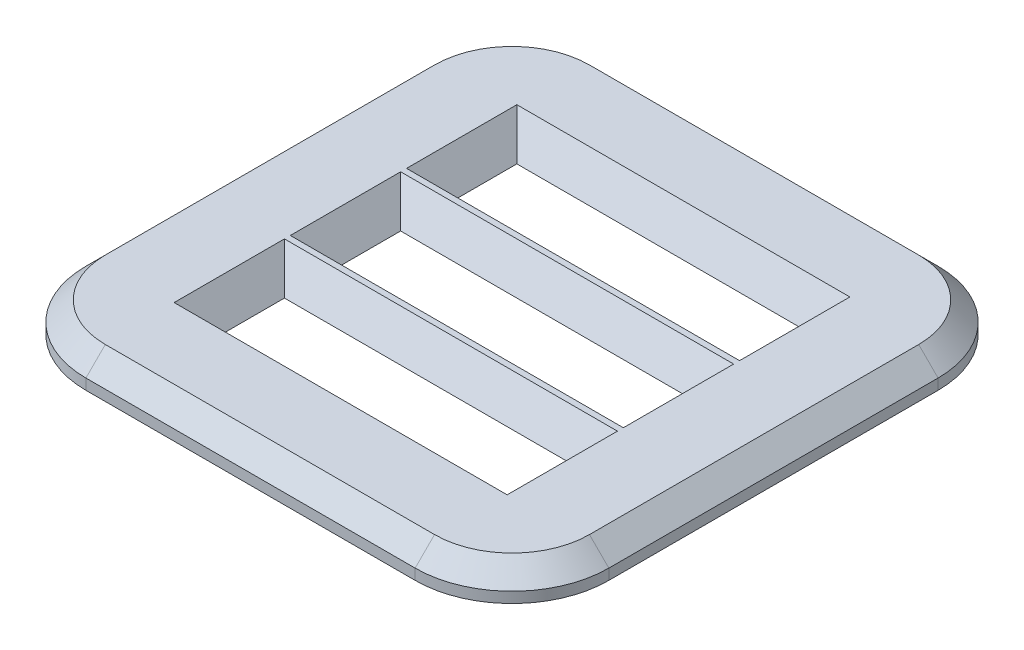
ISO-10303-21;
HEADER;
FILE_DESCRIPTION(('STEP AP214'),'2;1');
FILE_NAME('part.step','',(''),(''),'','','');
FILE_SCHEMA(('AUTOMOTIVE_DESIGN { 1 0 10303 214 1 1 1 1 }'));
ENDSEC;
DATA;
#1=APPLICATION_CONTEXT('core data for automotive mechanical design processes');
#2=APPLICATION_PROTOCOL_DEFINITION('international standard','automotive_design',2000,#1);
#3=PRODUCT_CONTEXT('',#1,'mechanical');
#4=PRODUCT('Part','Part','',(#3));
#5=PRODUCT_RELATED_PRODUCT_CATEGORY('part','',(#4));
#6=PRODUCT_DEFINITION_FORMATION('','',#4);
#7=PRODUCT_DEFINITION_CONTEXT('part definition',#1,'design');
#8=PRODUCT_DEFINITION('design','',#6,#7);
#9=PRODUCT_DEFINITION_SHAPE('','',#8);
#10=(LENGTH_UNIT() NAMED_UNIT(*) SI_UNIT(.MILLI.,.METRE.));
#11=(NAMED_UNIT(*) PLANE_ANGLE_UNIT() SI_UNIT($,.RADIAN.));
#12=(NAMED_UNIT(*) SI_UNIT($,.STERADIAN.) SOLID_ANGLE_UNIT());
#13=UNCERTAINTY_MEASURE_WITH_UNIT(LENGTH_MEASURE(1.E-05),#10,'distance_accuracy_value','');
#14=(GEOMETRIC_REPRESENTATION_CONTEXT(3) GLOBAL_UNCERTAINTY_ASSIGNED_CONTEXT((#13)) GLOBAL_UNIT_ASSIGNED_CONTEXT((#10,
#11,#12)) REPRESENTATION_CONTEXT('',''));
#15=CARTESIAN_POINT('',(0.,0.,0.));
#16=DIRECTION('',(0.,0.,1.));
#17=DIRECTION('',(1.,0.,0.));
#18=AXIS2_PLACEMENT_3D('',#15,#16,#17);
#19=CARTESIAN_POINT('',(-2.7,0.31,-2.7));
#20=DIRECTION('',(1.,0.,0.));
#21=DIRECTION('',(0.,0.,-1.));
#22=AXIS2_PLACEMENT_3D('',#19,#20,#21);
#23=PLANE('',#22);
#24=DIRECTION('',(0.,-1.,0.));
#25=VECTOR('',#24,1.);
#26=CARTESIAN_POINT('',(-2.7,0.31,1.7));
#27=LINE('',#26,#25);
#28=CARTESIAN_POINT('',(-2.7,0.,1.7));
#29=VERTEX_POINT('',#28);
#30=CARTESIAN_POINT('',(-2.7,0.11,1.7));
#31=VERTEX_POINT('',#30);
#32=EDGE_CURVE('E268',#29,#31,#27,.F.);
#33=ORIENTED_EDGE('',*,*,#32,.T.);
#34=DIRECTION('',(0.,0.,-1.));
#35=VECTOR('',#34,1.);
#36=CARTESIAN_POINT('',(-2.7,0.11,-2.7));
#37=LINE('',#36,#35);
#38=CARTESIAN_POINT('',(-2.7,0.11,-1.7));
#39=VERTEX_POINT('',#38);
#40=EDGE_CURVE('E320',#31,#39,#37,.T.);
#41=ORIENTED_EDGE('',*,*,#40,.T.);
#42=DIRECTION('',(0.,-1.,0.));
#43=VECTOR('',#42,1.);
#44=CARTESIAN_POINT('',(-2.7,0.31,-1.7));
#45=LINE('',#44,#43);
#46=CARTESIAN_POINT('',(-2.7,0.,-1.7));
#47=VERTEX_POINT('',#46);
#48=EDGE_CURVE('E271',#39,#47,#45,.T.);
#49=ORIENTED_EDGE('',*,*,#48,.T.);
#50=DIRECTION('',(0.,0.,1.));
#51=VECTOR('',#50,1.);
#52=CARTESIAN_POINT('',(-2.7,0.,-2.7));
#53=LINE('',#52,#51);
#54=EDGE_CURVE('E255',#47,#29,#53,.T.);
#55=ORIENTED_EDGE('',*,*,#54,.T.);
#56=EDGE_LOOP('',(#33,#41,#49,#55));
#57=FACE_BOUND('',#56,.T.);
#58=ADVANCED_FACE('F43',(#57),#23,.F.);
#59=CARTESIAN_POINT('',(2.7,0.31,2.7));
#60=DIRECTION('',(0.,0.,-1.));
#61=DIRECTION('',(-1.,0.,0.));
#62=AXIS2_PLACEMENT_3D('',#59,#60,#61);
#63=PLANE('',#62);
#64=DIRECTION('',(0.,-1.,0.));
#65=VECTOR('',#64,1.);
#66=CARTESIAN_POINT('',(1.7,0.31,2.7));
#67=LINE('',#66,#65);
#68=CARTESIAN_POINT('',(1.7,0.,2.7));
#69=VERTEX_POINT('',#68);
#70=CARTESIAN_POINT('',(1.7,0.11,2.7));
#71=VERTEX_POINT('',#70);
#72=EDGE_CURVE('E293',#69,#71,#67,.F.);
#73=ORIENTED_EDGE('',*,*,#72,.T.);
#74=DIRECTION('',(-1.,0.,0.));
#75=VECTOR('',#74,1.);
#76=CARTESIAN_POINT('',(2.7,0.11,2.7));
#77=LINE('',#76,#75);
#78=CARTESIAN_POINT('',(-1.7,0.11,2.7));
#79=VERTEX_POINT('',#78);
#80=EDGE_CURVE('E316',#71,#79,#77,.T.);
#81=ORIENTED_EDGE('',*,*,#80,.T.);
#82=DIRECTION('',(0.,-1.,0.));
#83=VECTOR('',#82,1.);
#84=CARTESIAN_POINT('',(-1.7,0.31,2.7));
#85=LINE('',#84,#83);
#86=CARTESIAN_POINT('',(-1.7,0.,2.7));
#87=VERTEX_POINT('',#86);
#88=EDGE_CURVE('E291',#79,#87,#85,.T.);
#89=ORIENTED_EDGE('',*,*,#88,.T.);
#90=DIRECTION('',(1.,0.,0.));
#91=VECTOR('',#90,1.);
#92=CARTESIAN_POINT('',(2.7,0.,2.7));
#93=LINE('',#92,#91);
#94=EDGE_CURVE('E258',#87,#69,#93,.T.);
#95=ORIENTED_EDGE('',*,*,#94,.T.);
#96=EDGE_LOOP('',(#73,#81,#89,#95));
#97=FACE_BOUND('',#96,.T.);
#98=ADVANCED_FACE('F477',(#97),#63,.F.);
#99=CARTESIAN_POINT('',(2.7,0.31,-2.7));
#100=DIRECTION('',(-1.,0.,0.));
#101=DIRECTION('',(0.,0.,1.));
#102=AXIS2_PLACEMENT_3D('',#99,#100,#101);
#103=PLANE('',#102);
#104=DIRECTION('',(0.,-1.,0.));
#105=VECTOR('',#104,1.);
#106=CARTESIAN_POINT('',(2.7,0.31,-1.7));
#107=LINE('',#106,#105);
#108=CARTESIAN_POINT('',(2.7,0.,-1.7));
#109=VERTEX_POINT('',#108);
#110=CARTESIAN_POINT('',(2.7,0.11,-1.7));
#111=VERTEX_POINT('',#110);
#112=EDGE_CURVE('E288',#109,#111,#107,.F.);
#113=ORIENTED_EDGE('',*,*,#112,.T.);
#114=DIRECTION('',(0.,0.,1.));
#115=VECTOR('',#114,1.);
#116=CARTESIAN_POINT('',(2.7,0.11,-2.7));
#117=LINE('',#116,#115);
#118=CARTESIAN_POINT('',(2.7,0.11,1.7));
#119=VERTEX_POINT('',#118);
#120=EDGE_CURVE('E328',#111,#119,#117,.T.);
#121=ORIENTED_EDGE('',*,*,#120,.T.);
#122=DIRECTION('',(0.,-1.,0.));
#123=VECTOR('',#122,1.);
#124=CARTESIAN_POINT('',(2.7,0.31,1.7));
#125=LINE('',#124,#123);
#126=CARTESIAN_POINT('',(2.7,0.,1.7));
#127=VERTEX_POINT('',#126);
#128=EDGE_CURVE('E286',#119,#127,#125,.T.);
#129=ORIENTED_EDGE('',*,*,#128,.T.);
#130=DIRECTION('',(0.,0.,-1.));
#131=VECTOR('',#130,1.);
#132=CARTESIAN_POINT('',(2.7,0.,-2.7));
#133=LINE('',#132,#131);
#134=EDGE_CURVE('E262',#127,#109,#133,.T.);
#135=ORIENTED_EDGE('',*,*,#134,.T.);
#136=EDGE_LOOP('',(#113,#121,#129,#135));
#137=FACE_BOUND('',#136,.T.);
#138=ADVANCED_FACE('F467',(#137),#103,.F.);
#139=CARTESIAN_POINT('',(2.7,0.31,-2.7));
#140=DIRECTION('',(0.,0.,1.));
#141=DIRECTION('',(1.,0.,0.));
#142=AXIS2_PLACEMENT_3D('',#139,#140,#141);
#143=PLANE('',#142);
#144=DIRECTION('',(0.,-1.,0.));
#145=VECTOR('',#144,1.);
#146=CARTESIAN_POINT('',(-1.7,0.31,-2.7));
#147=LINE('',#146,#145);
#148=CARTESIAN_POINT('',(-1.7,0.,-2.7));
#149=VERTEX_POINT('',#148);
#150=CARTESIAN_POINT('',(-1.7,0.11,-2.7));
#151=VERTEX_POINT('',#150);
#152=EDGE_CURVE('E283',#149,#151,#147,.F.);
#153=ORIENTED_EDGE('',*,*,#152,.T.);
#154=DIRECTION('',(1.,0.,0.));
#155=VECTOR('',#154,1.);
#156=CARTESIAN_POINT('',(2.7,0.11,-2.7));
#157=LINE('',#156,#155);
#158=CARTESIAN_POINT('',(1.7,0.11,-2.7));
#159=VERTEX_POINT('',#158);
#160=EDGE_CURVE('E324',#151,#159,#157,.T.);
#161=ORIENTED_EDGE('',*,*,#160,.T.);
#162=DIRECTION('',(0.,-1.,0.));
#163=VECTOR('',#162,1.);
#164=CARTESIAN_POINT('',(1.7,0.31,-2.7));
#165=LINE('',#164,#163);
#166=CARTESIAN_POINT('',(1.7,0.,-2.7));
#167=VERTEX_POINT('',#166);
#168=EDGE_CURVE('E281',#159,#167,#165,.T.);
#169=ORIENTED_EDGE('',*,*,#168,.T.);
#170=DIRECTION('',(-1.,0.,0.));
#171=VECTOR('',#170,1.);
#172=CARTESIAN_POINT('',(2.7,0.,-2.7));
#173=LINE('',#172,#171);
#174=EDGE_CURVE('E265',#167,#149,#173,.T.);
#175=ORIENTED_EDGE('',*,*,#174,.T.);
#176=EDGE_LOOP('',(#153,#161,#169,#175));
#177=FACE_BOUND('',#176,.T.);
#178=ADVANCED_FACE('F460',(#177),#143,.F.);
#179=CARTESIAN_POINT('',(0.,0.31,0.));
#180=DIRECTION('',(0.,-1.,0.));
#181=DIRECTION('',(0.,0.,-1.));
#182=AXIS2_PLACEMENT_3D('',#179,#180,#181);
#183=PLANE('',#182);
#184=DIRECTION('',(-1.,0.,0.));
#185=VECTOR('',#184,1.);
#186=CARTESIAN_POINT('',(0.,0.31,1.76949223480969));
#187=LINE('',#186,#185);
#188=CARTESIAN_POINT('',(1.71949223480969,0.31,1.76949223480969));
#189=VERTEX_POINT('',#188);
#190=CARTESIAN_POINT('',(-1.71949223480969,0.31,1.76949223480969));
#191=VERTEX_POINT('',#190);
#192=EDGE_CURVE('E53',#189,#191,#187,.T.);
#193=ORIENTED_EDGE('',*,*,#192,.T.);
#194=DIRECTION('',(0.,0.,-1.));
#195=VECTOR('',#194,1.);
#196=CARTESIAN_POINT('',(-1.71949223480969,0.31,0.));
#197=LINE('',#196,#195);
#198=CARTESIAN_POINT('',(-1.71949223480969,0.31,0.630507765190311));
#199=VERTEX_POINT('',#198);
#200=EDGE_CURVE('E11',#191,#199,#197,.T.);
#201=ORIENTED_EDGE('',*,*,#200,.T.);
#202=DIRECTION('',(1.,0.,0.));
#203=VECTOR('',#202,1.);
#204=CARTESIAN_POINT('',(0.,0.31,0.630507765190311));
#205=LINE('',#204,#203);
#206=CARTESIAN_POINT('',(1.71949223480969,0.31,0.630507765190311));
#207=VERTEX_POINT('',#206);
#208=EDGE_CURVE('E366',#199,#207,#205,.T.);
#209=ORIENTED_EDGE('',*,*,#208,.T.);
#210=DIRECTION('',(0.,0.,1.));
#211=VECTOR('',#210,1.);
#212=CARTESIAN_POINT('',(1.71949223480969,0.31,0.));
#213=LINE('',#212,#211);
#214=EDGE_CURVE('E64',#207,#189,#213,.T.);
#215=ORIENTED_EDGE('',*,*,#214,.T.);
#216=EDGE_LOOP('',(#193,#201,#209,#215));
#217=FACE_BOUND('',#216,.T.);
#218=DIRECTION('',(1.,0.,0.));
#219=VECTOR('',#218,1.);
#220=CARTESIAN_POINT('',(0.,0.31,-1.76949223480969));
#221=LINE('',#220,#219);
#222=CARTESIAN_POINT('',(-1.71949223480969,0.31,-1.76949223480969));
#223=VERTEX_POINT('',#222);
#224=CARTESIAN_POINT('',(1.71949223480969,0.31,-1.76949223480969));
#225=VERTEX_POINT('',#224);
#226=EDGE_CURVE('E361',#223,#225,#221,.T.);
#227=ORIENTED_EDGE('',*,*,#226,.T.);
#228=DIRECTION('',(0.,0.,1.));
#229=VECTOR('',#228,1.);
#230=CARTESIAN_POINT('',(1.71949223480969,0.31,0.));
#231=LINE('',#230,#229);
#232=CARTESIAN_POINT('',(1.71949223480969,0.31,-0.630507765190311));
#233=VERTEX_POINT('',#232);
#234=EDGE_CURVE('E364',#225,#233,#231,.T.);
#235=ORIENTED_EDGE('',*,*,#234,.T.);
#236=DIRECTION('',(-1.,0.,0.));
#237=VECTOR('',#236,1.);
#238=CARTESIAN_POINT('',(0.,0.31,-0.630507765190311));
#239=LINE('',#238,#237);
#240=CARTESIAN_POINT('',(-1.71949223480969,0.31,-0.630507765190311));
#241=VERTEX_POINT('',#240);
#242=EDGE_CURVE('E221',#233,#241,#239,.T.);
#243=ORIENTED_EDGE('',*,*,#242,.T.);
#244=DIRECTION('',(0.,0.,-1.));
#245=VECTOR('',#244,1.);
#246=CARTESIAN_POINT('',(-1.71949223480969,0.31,0.));
#247=LINE('',#246,#245);
#248=EDGE_CURVE('E359',#241,#223,#247,.T.);
#249=ORIENTED_EDGE('',*,*,#248,.T.);
#250=EDGE_LOOP('',(#227,#235,#243,#249));
#251=FACE_BOUND('',#250,.T.);
#252=DIRECTION('',(0.,0.,1.));
#253=VECTOR('',#252,1.);
#254=CARTESIAN_POINT('',(1.71949223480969,0.31,0.));
#255=LINE('',#254,#253);
#256=CARTESIAN_POINT('',(1.71949223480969,0.31,-0.569492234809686));
#257=VERTEX_POINT('',#256);
#258=CARTESIAN_POINT('',(1.71949223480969,0.31,0.569492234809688));
#259=VERTEX_POINT('',#258);
#260=EDGE_CURVE('E354',#257,#259,#255,.T.);
#261=ORIENTED_EDGE('',*,*,#260,.T.);
#262=DIRECTION('',(-1.,0.,0.));
#263=VECTOR('',#262,1.);
#264=CARTESIAN_POINT('',(0.,0.31,0.569492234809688));
#265=LINE('',#264,#263);
#266=CARTESIAN_POINT('',(-1.71949223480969,0.31,0.569492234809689));
#267=VERTEX_POINT('',#266);
#268=EDGE_CURVE('E356',#259,#267,#265,.T.);
#269=ORIENTED_EDGE('',*,*,#268,.T.);
#270=DIRECTION('',(0.,0.,-1.));
#271=VECTOR('',#270,1.);
#272=CARTESIAN_POINT('',(-1.71949223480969,0.31,0.));
#273=LINE('',#272,#271);
#274=CARTESIAN_POINT('',(-1.71949223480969,0.31,-0.569492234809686));
#275=VERTEX_POINT('',#274);
#276=EDGE_CURVE('E352',#267,#275,#273,.T.);
#277=ORIENTED_EDGE('',*,*,#276,.T.);
#278=DIRECTION('',(1.,0.,0.));
#279=VECTOR('',#278,1.);
#280=CARTESIAN_POINT('',(0.,0.31,-0.569492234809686));
#281=LINE('',#280,#279);
#282=EDGE_CURVE('E330',#275,#257,#281,.T.);
#283=ORIENTED_EDGE('',*,*,#282,.T.);
#284=EDGE_LOOP('',(#261,#269,#277,#283));
#285=FACE_BOUND('',#284,.T.);
#286=DIRECTION('',(1.,0.,0.));
#287=VECTOR('',#286,1.);
#288=CARTESIAN_POINT('',(0.,0.31,2.5));
#289=LINE('',#288,#287);
#290=CARTESIAN_POINT('',(-1.7,0.31,2.5));
#291=VERTEX_POINT('',#290);
#292=CARTESIAN_POINT('',(1.7,0.31,2.5));
#293=VERTEX_POINT('',#292);
#294=EDGE_CURVE('E308',#291,#293,#289,.T.);
#295=ORIENTED_EDGE('',*,*,#294,.T.);
#296=CARTESIAN_POINT('',(1.7,0.31,1.7));
#297=DIRECTION('',(0.,-1.,0.));
#298=DIRECTION('',(0.,0.,-1.));
#299=AXIS2_PLACEMENT_3D('',#296,#297,#298);
#300=CIRCLE('',#299,0.800000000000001);
#301=CARTESIAN_POINT('',(2.5,0.31,1.7));
#302=VERTEX_POINT('',#301);
#303=EDGE_CURVE('E310',#293,#302,#300,.F.);
#304=ORIENTED_EDGE('',*,*,#303,.T.);
#305=DIRECTION('',(0.,0.,-1.));
#306=VECTOR('',#305,1.);
#307=CARTESIAN_POINT('',(2.5,0.31,0.));
#308=LINE('',#307,#306);
#309=CARTESIAN_POINT('',(2.5,0.31,-1.7));
#310=VERTEX_POINT('',#309);
#311=EDGE_CURVE('E296',#302,#310,#308,.T.);
#312=ORIENTED_EDGE('',*,*,#311,.T.);
#313=CARTESIAN_POINT('',(1.7,0.31,-1.7));
#314=DIRECTION('',(0.,-1.,0.));
#315=DIRECTION('',(0.,0.,-1.));
#316=AXIS2_PLACEMENT_3D('',#313,#314,#315);
#317=CIRCLE('',#316,0.800000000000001);
#318=CARTESIAN_POINT('',(1.7,0.31,-2.5));
#319=VERTEX_POINT('',#318);
#320=EDGE_CURVE('E298',#310,#319,#317,.F.);
#321=ORIENTED_EDGE('',*,*,#320,.T.);
#322=DIRECTION('',(-1.,0.,0.));
#323=VECTOR('',#322,1.);
#324=CARTESIAN_POINT('',(0.,0.31,-2.5));
#325=LINE('',#324,#323);
#326=CARTESIAN_POINT('',(-1.7,0.31,-2.5));
#327=VERTEX_POINT('',#326);
#328=EDGE_CURVE('E300',#319,#327,#325,.T.);
#329=ORIENTED_EDGE('',*,*,#328,.T.);
#330=CARTESIAN_POINT('',(-1.7,0.31,-1.7));
#331=DIRECTION('',(0.,-1.,0.));
#332=DIRECTION('',(0.,0.,-1.));
#333=AXIS2_PLACEMENT_3D('',#330,#331,#332);
#334=CIRCLE('',#333,0.800000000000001);
#335=CARTESIAN_POINT('',(-2.5,0.31,-1.7));
#336=VERTEX_POINT('',#335);
#337=EDGE_CURVE('E302',#327,#336,#334,.F.);
#338=ORIENTED_EDGE('',*,*,#337,.T.);
#339=DIRECTION('',(0.,0.,1.));
#340=VECTOR('',#339,1.);
#341=CARTESIAN_POINT('',(-2.5,0.31,0.));
#342=LINE('',#341,#340);
#343=CARTESIAN_POINT('',(-2.5,0.31,1.7));
#344=VERTEX_POINT('',#343);
#345=EDGE_CURVE('E304',#336,#344,#342,.T.);
#346=ORIENTED_EDGE('',*,*,#345,.T.);
#347=CARTESIAN_POINT('',(-1.7,0.31,1.7));
#348=DIRECTION('',(0.,-1.,0.));
#349=DIRECTION('',(0.,0.,-1.));
#350=AXIS2_PLACEMENT_3D('',#347,#348,#349);
#351=CIRCLE('',#350,0.800000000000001);
#352=EDGE_CURVE('E306',#344,#291,#351,.F.);
#353=ORIENTED_EDGE('',*,*,#352,.T.);
#354=EDGE_LOOP('',(#295,#304,#312,#321,#329,#338,#346,#353));
#355=FACE_BOUND('',#354,.T.);
#356=ADVANCED_FACE('F404',(#217,#251,#285,#355),#183,.F.);
#357=CARTESIAN_POINT('',(0.,0.,0.));
#358=DIRECTION('',(0.,-1.,0.));
#359=DIRECTION('',(0.,0.,-1.));
#360=AXIS2_PLACEMENT_3D('',#357,#358,#359);
#361=PLANE('',#360);
#362=DIRECTION('',(-1.,0.,0.));
#363=VECTOR('',#362,1.);
#364=CARTESIAN_POINT('',(1.5,0.,0.849999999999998));
#365=LINE('',#364,#363);
#366=CARTESIAN_POINT('',(1.5,0.,0.849999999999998));
#367=VERTEX_POINT('',#366);
#368=CARTESIAN_POINT('',(-1.5,0.,0.849999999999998));
#369=VERTEX_POINT('',#368);
#370=EDGE_CURVE('E216',#367,#369,#365,.T.);
#371=ORIENTED_EDGE('',*,*,#370,.T.);
#372=DIRECTION('',(0.,0.,1.));
#373=VECTOR('',#372,1.);
#374=CARTESIAN_POINT('',(-1.5,0.,0.849999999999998));
#375=LINE('',#374,#373);
#376=CARTESIAN_POINT('',(-1.5,0.,1.55));
#377=VERTEX_POINT('',#376);
#378=EDGE_CURVE('E244',#369,#377,#375,.T.);
#379=ORIENTED_EDGE('',*,*,#378,.T.);
#380=DIRECTION('',(1.,0.,0.));
#381=VECTOR('',#380,1.);
#382=CARTESIAN_POINT('',(1.5,0.,1.55));
#383=LINE('',#382,#381);
#384=CARTESIAN_POINT('',(1.5,0.,1.55));
#385=VERTEX_POINT('',#384);
#386=EDGE_CURVE('E241',#377,#385,#383,.T.);
#387=ORIENTED_EDGE('',*,*,#386,.T.);
#388=DIRECTION('',(0.,0.,-1.));
#389=VECTOR('',#388,1.);
#390=CARTESIAN_POINT('',(1.5,0.,0.849999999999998));
#391=LINE('',#390,#389);
#392=EDGE_CURVE('E239',#385,#367,#391,.T.);
#393=ORIENTED_EDGE('',*,*,#392,.T.);
#394=EDGE_LOOP('',(#371,#379,#387,#393));
#395=FACE_BOUND('',#394,.T.);
#396=DIRECTION('',(0.,0.,-1.));
#397=VECTOR('',#396,1.);
#398=CARTESIAN_POINT('',(1.5,0.,-0.849999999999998));
#399=LINE('',#398,#397);
#400=CARTESIAN_POINT('',(1.5,0.,-0.849999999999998));
#401=VERTEX_POINT('',#400);
#402=CARTESIAN_POINT('',(1.5,0.,-1.55));
#403=VERTEX_POINT('',#402);
#404=EDGE_CURVE('E210',#401,#403,#399,.T.);
#405=ORIENTED_EDGE('',*,*,#404,.T.);
#406=DIRECTION('',(-1.,0.,0.));
#407=VECTOR('',#406,1.);
#408=CARTESIAN_POINT('',(1.5,0.,-1.55));
#409=LINE('',#408,#407);
#410=CARTESIAN_POINT('',(-1.5,0.,-1.55));
#411=VERTEX_POINT('',#410);
#412=EDGE_CURVE('E232',#403,#411,#409,.T.);
#413=ORIENTED_EDGE('',*,*,#412,.T.);
#414=DIRECTION('',(0.,0.,1.));
#415=VECTOR('',#414,1.);
#416=CARTESIAN_POINT('',(-1.5,0.,-0.849999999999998));
#417=LINE('',#416,#415);
#418=CARTESIAN_POINT('',(-1.5,0.,-0.849999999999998));
#419=VERTEX_POINT('',#418);
#420=EDGE_CURVE('E212',#411,#419,#417,.T.);
#421=ORIENTED_EDGE('',*,*,#420,.T.);
#422=DIRECTION('',(1.,0.,0.));
#423=VECTOR('',#422,1.);
#424=CARTESIAN_POINT('',(1.5,0.,-0.849999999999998));
#425=LINE('',#424,#423);
#426=EDGE_CURVE('E205',#419,#401,#425,.T.);
#427=ORIENTED_EDGE('',*,*,#426,.T.);
#428=EDGE_LOOP('',(#405,#413,#421,#427));
#429=FACE_BOUND('',#428,.T.);
#430=DIRECTION('',(0.,0.,1.));
#431=VECTOR('',#430,1.);
#432=CARTESIAN_POINT('',(-1.5,0.,-0.349999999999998));
#433=LINE('',#432,#431);
#434=CARTESIAN_POINT('',(-1.5,0.,-0.349999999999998));
#435=VERTEX_POINT('',#434);
#436=CARTESIAN_POINT('',(-1.5,0.,0.350000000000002));
#437=VERTEX_POINT('',#436);
#438=EDGE_CURVE('E231',#435,#437,#433,.T.);
#439=ORIENTED_EDGE('',*,*,#438,.T.);
#440=DIRECTION('',(1.,0.,0.));
#441=VECTOR('',#440,1.);
#442=CARTESIAN_POINT('',(1.5,0.,0.350000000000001));
#443=LINE('',#442,#441);
#444=CARTESIAN_POINT('',(1.5,0.,0.350000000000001));
#445=VERTEX_POINT('',#444);
#446=EDGE_CURVE('E234',#437,#445,#443,.T.);
#447=ORIENTED_EDGE('',*,*,#446,.T.);
#448=DIRECTION('',(0.,0.,-1.));
#449=VECTOR('',#448,1.);
#450=CARTESIAN_POINT('',(1.5,0.,-0.349999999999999));
#451=LINE('',#450,#449);
#452=CARTESIAN_POINT('',(1.5,0.,-0.349999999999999));
#453=VERTEX_POINT('',#452);
#454=EDGE_CURVE('E250',#445,#453,#451,.T.);
#455=ORIENTED_EDGE('',*,*,#454,.T.);
#456=DIRECTION('',(-1.,0.,0.));
#457=VECTOR('',#456,1.);
#458=CARTESIAN_POINT('',(1.5,0.,-0.349999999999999));
#459=LINE('',#458,#457);
#460=EDGE_CURVE('E252',#453,#435,#459,.T.);
#461=ORIENTED_EDGE('',*,*,#460,.T.);
#462=EDGE_LOOP('',(#439,#447,#455,#461));
#463=FACE_BOUND('',#462,.T.);
#464=ORIENTED_EDGE('',*,*,#54,.F.);
#465=CARTESIAN_POINT('',(-1.7,0.,-1.7));
#466=DIRECTION('',(0.,-1.,0.));
#467=DIRECTION('',(0.,0.,-1.));
#468=AXIS2_PLACEMENT_3D('',#465,#466,#467);
#469=CIRCLE('',#468,1.);
#470=EDGE_CURVE('E279',#47,#149,#469,.T.);
#471=ORIENTED_EDGE('',*,*,#470,.T.);
#472=ORIENTED_EDGE('',*,*,#174,.F.);
#473=CARTESIAN_POINT('',(1.7,0.,-1.7));
#474=DIRECTION('',(0.,-1.,0.));
#475=DIRECTION('',(0.,0.,-1.));
#476=AXIS2_PLACEMENT_3D('',#473,#474,#475);
#477=CIRCLE('',#476,1.);
#478=EDGE_CURVE('E277',#167,#109,#477,.T.);
#479=ORIENTED_EDGE('',*,*,#478,.T.);
#480=ORIENTED_EDGE('',*,*,#134,.F.);
#481=CARTESIAN_POINT('',(1.7,0.,1.7));
#482=DIRECTION('',(0.,-1.,0.));
#483=DIRECTION('',(0.,0.,-1.));
#484=AXIS2_PLACEMENT_3D('',#481,#482,#483);
#485=CIRCLE('',#484,1.);
#486=EDGE_CURVE('E275',#127,#69,#485,.T.);
#487=ORIENTED_EDGE('',*,*,#486,.T.);
#488=ORIENTED_EDGE('',*,*,#94,.F.);
#489=CARTESIAN_POINT('',(-1.7,0.,1.7));
#490=DIRECTION('',(0.,-1.,0.));
#491=DIRECTION('',(0.,0.,-1.));
#492=AXIS2_PLACEMENT_3D('',#489,#490,#491);
#493=CIRCLE('',#492,1.);
#494=EDGE_CURVE('E273',#87,#29,#493,.T.);
#495=ORIENTED_EDGE('',*,*,#494,.T.);
#496=EDGE_LOOP('',(#464,#471,#472,#479,#480,#487,#488,#495));
#497=FACE_BOUND('',#496,.T.);
#498=ADVANCED_FACE('F207',(#395,#429,#463,#497),#361,.T.);
#499=CARTESIAN_POINT('',(-1.7,0.31,-1.7));
#500=DIRECTION('',(0.,-1.,0.));
#501=DIRECTION('',(0.,0.,-1.));
#502=AXIS2_PLACEMENT_3D('',#499,#500,#501);
#503=CYLINDRICAL_SURFACE('',#502,1.);
#504=ORIENTED_EDGE('',*,*,#48,.F.);
#505=CARTESIAN_POINT('',(-1.7,0.11,-1.7));
#506=DIRECTION('',(0.,-1.,0.));
#507=DIRECTION('',(0.,0.,-1.));
#508=AXIS2_PLACEMENT_3D('',#505,#506,#507);
#509=CIRCLE('',#508,1.);
#510=EDGE_CURVE('E322',#39,#151,#509,.T.);
#511=ORIENTED_EDGE('',*,*,#510,.T.);
#512=ORIENTED_EDGE('',*,*,#152,.F.);
#513=ORIENTED_EDGE('',*,*,#470,.F.);
#514=EDGE_LOOP('',(#504,#511,#512,#513));
#515=FACE_BOUND('',#514,.T.);
#516=ADVANCED_FACE('F414',(#515),#503,.T.);
#517=CARTESIAN_POINT('',(1.7,0.31,-1.7));
#518=DIRECTION('',(0.,-1.,0.));
#519=DIRECTION('',(0.,0.,-1.));
#520=AXIS2_PLACEMENT_3D('',#517,#518,#519);
#521=CYLINDRICAL_SURFACE('',#520,1.);
#522=ORIENTED_EDGE('',*,*,#168,.F.);
#523=CARTESIAN_POINT('',(1.7,0.11,-1.7));
#524=DIRECTION('',(0.,-1.,0.));
#525=DIRECTION('',(0.,0.,-1.));
#526=AXIS2_PLACEMENT_3D('',#523,#524,#525);
#527=CIRCLE('',#526,1.);
#528=EDGE_CURVE('E326',#159,#111,#527,.T.);
#529=ORIENTED_EDGE('',*,*,#528,.T.);
#530=ORIENTED_EDGE('',*,*,#112,.F.);
#531=ORIENTED_EDGE('',*,*,#478,.F.);
#532=EDGE_LOOP('',(#522,#529,#530,#531));
#533=FACE_BOUND('',#532,.T.);
#534=ADVANCED_FACE('F463',(#533),#521,.T.);
#535=CARTESIAN_POINT('',(1.7,0.31,1.7));
#536=DIRECTION('',(0.,-1.,0.));
#537=DIRECTION('',(0.,0.,-1.));
#538=AXIS2_PLACEMENT_3D('',#535,#536,#537);
#539=CYLINDRICAL_SURFACE('',#538,1.);
#540=ORIENTED_EDGE('',*,*,#128,.F.);
#541=CARTESIAN_POINT('',(1.7,0.11,1.7));
#542=DIRECTION('',(0.,-1.,0.));
#543=DIRECTION('',(0.,0.,-1.));
#544=AXIS2_PLACEMENT_3D('',#541,#542,#543);
#545=CIRCLE('',#544,1.);
#546=EDGE_CURVE('E313',#119,#71,#545,.T.);
#547=ORIENTED_EDGE('',*,*,#546,.T.);
#548=ORIENTED_EDGE('',*,*,#72,.F.);
#549=ORIENTED_EDGE('',*,*,#486,.F.);
#550=EDGE_LOOP('',(#540,#547,#548,#549));
#551=FACE_BOUND('',#550,.T.);
#552=ADVANCED_FACE('F475',(#551),#539,.T.);
#553=CARTESIAN_POINT('',(-1.7,0.31,1.7));
#554=DIRECTION('',(0.,-1.,0.));
#555=DIRECTION('',(0.,0.,-1.));
#556=AXIS2_PLACEMENT_3D('',#553,#554,#555);
#557=CYLINDRICAL_SURFACE('',#556,1.);
#558=ORIENTED_EDGE('',*,*,#88,.F.);
#559=CARTESIAN_POINT('',(-1.7,0.11,1.7));
#560=DIRECTION('',(0.,-1.,0.));
#561=DIRECTION('',(0.,0.,-1.));
#562=AXIS2_PLACEMENT_3D('',#559,#560,#561);
#563=CIRCLE('',#562,1.);
#564=EDGE_CURVE('E318',#79,#31,#563,.T.);
#565=ORIENTED_EDGE('',*,*,#564,.T.);
#566=ORIENTED_EDGE('',*,*,#32,.F.);
#567=ORIENTED_EDGE('',*,*,#494,.F.);
#568=EDGE_LOOP('',(#558,#565,#566,#567));
#569=FACE_BOUND('',#568,.T.);
#570=ADVANCED_FACE('F428',(#569),#557,.T.);
#571=CARTESIAN_POINT('',(-1.7,0.31,-1.7));
#572=DIRECTION('',(0.,-1.,0.));
#573=DIRECTION('',(0.,0.,-1.));
#574=AXIS2_PLACEMENT_3D('',#571,#572,#573);
#575=CONICAL_SURFACE('',#574,0.800000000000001,0.785398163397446);
#576=DIRECTION('',(0.,0.707106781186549,0.707106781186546));
#577=VECTOR('',#576,1.);
#578=CARTESIAN_POINT('',(-1.7,0.11,-2.7));
#579=LINE('',#578,#577);
#580=EDGE_CURVE('E346',#151,#327,#579,.T.);
#581=ORIENTED_EDGE('',*,*,#580,.F.);
#582=ORIENTED_EDGE('',*,*,#510,.F.);
#583=DIRECTION('',(-0.707106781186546,-0.707106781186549,0.));
#584=VECTOR('',#583,1.);
#585=CARTESIAN_POINT('',(-2.5,0.31,-1.7));
#586=LINE('',#585,#584);
#587=EDGE_CURVE('E259',#336,#39,#586,.T.);
#588=ORIENTED_EDGE('',*,*,#587,.F.);
#589=ORIENTED_EDGE('',*,*,#337,.F.);
#590=EDGE_LOOP('',(#581,#582,#588,#589));
#591=FACE_BOUND('',#590,.T.);
#592=ADVANCED_FACE('F451',(#591),#575,.T.);
#593=CARTESIAN_POINT('',(-2.5,0.31,0.));
#594=DIRECTION('',(0.707106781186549,-0.707106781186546,0.));
#595=DIRECTION('',(0.,0.,1.));
#596=AXIS2_PLACEMENT_3D('',#593,#594,#595);
#597=PLANE('',#596);
#598=ORIENTED_EDGE('',*,*,#587,.T.);
#599=ORIENTED_EDGE('',*,*,#40,.F.);
#600=DIRECTION('',(-0.707106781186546,-0.707106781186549,0.));
#601=VECTOR('',#600,1.);
#602=CARTESIAN_POINT('',(-2.5,0.31,1.7));
#603=LINE('',#602,#601);
#604=EDGE_CURVE('E343',#344,#31,#603,.T.);
#605=ORIENTED_EDGE('',*,*,#604,.F.);
#606=ORIENTED_EDGE('',*,*,#345,.F.);
#607=EDGE_LOOP('',(#598,#599,#605,#606));
#608=FACE_BOUND('',#607,.T.);
#609=ADVANCED_FACE('F445',(#608),#597,.F.);
#610=CARTESIAN_POINT('',(0.,0.31,-2.5));
#611=DIRECTION('',(0.,-0.707106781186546,0.707106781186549));
#612=DIRECTION('',(-1.,0.,0.));
#613=AXIS2_PLACEMENT_3D('',#610,#611,#612);
#614=PLANE('',#613);
#615=ORIENTED_EDGE('',*,*,#580,.T.);
#616=ORIENTED_EDGE('',*,*,#328,.F.);
#617=DIRECTION('',(0.,0.707106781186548,0.707106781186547));
#618=VECTOR('',#617,1.);
#619=CARTESIAN_POINT('',(1.7,0.11,-2.7));
#620=LINE('',#619,#618);
#621=EDGE_CURVE('E340',#159,#319,#620,.T.);
#622=ORIENTED_EDGE('',*,*,#621,.F.);
#623=ORIENTED_EDGE('',*,*,#160,.F.);
#624=EDGE_LOOP('',(#615,#616,#622,#623));
#625=FACE_BOUND('',#624,.T.);
#626=ADVANCED_FACE('F456',(#625),#614,.F.);
#627=CARTESIAN_POINT('',(-1.7,0.31,1.7));
#628=DIRECTION('',(0.,-1.,0.));
#629=DIRECTION('',(0.,0.,-1.));
#630=AXIS2_PLACEMENT_3D('',#627,#628,#629);
#631=CONICAL_SURFACE('',#630,0.800000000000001,0.785398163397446);
#632=ORIENTED_EDGE('',*,*,#604,.T.);
#633=ORIENTED_EDGE('',*,*,#564,.F.);
#634=DIRECTION('',(0.,-0.707106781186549,0.707106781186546));
#635=VECTOR('',#634,1.);
#636=CARTESIAN_POINT('',(-1.7,0.31,2.5));
#637=LINE('',#636,#635);
#638=EDGE_CURVE('E337',#291,#79,#637,.T.);
#639=ORIENTED_EDGE('',*,*,#638,.F.);
#640=ORIENTED_EDGE('',*,*,#352,.F.);
#641=EDGE_LOOP('',(#632,#633,#639,#640));
#642=FACE_BOUND('',#641,.T.);
#643=ADVANCED_FACE('F432',(#642),#631,.T.);
#644=CARTESIAN_POINT('',(1.7,0.31,-1.7));
#645=DIRECTION('',(0.,-1.,0.));
#646=DIRECTION('',(0.,0.,-1.));
#647=AXIS2_PLACEMENT_3D('',#644,#645,#646);
#648=CONICAL_SURFACE('',#647,0.800000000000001,0.785398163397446);
#649=ORIENTED_EDGE('',*,*,#621,.T.);
#650=ORIENTED_EDGE('',*,*,#320,.F.);
#651=DIRECTION('',(-0.707106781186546,0.707106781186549,0.));
#652=VECTOR('',#651,1.);
#653=CARTESIAN_POINT('',(2.7,0.11,-1.7));
#654=LINE('',#653,#652);
#655=EDGE_CURVE('E334',#111,#310,#654,.T.);
#656=ORIENTED_EDGE('',*,*,#655,.F.);
#657=ORIENTED_EDGE('',*,*,#528,.F.);
#658=EDGE_LOOP('',(#649,#650,#656,#657));
#659=FACE_BOUND('',#658,.T.);
#660=ADVANCED_FACE('F518',(#659),#648,.T.);
#661=CARTESIAN_POINT('',(0.,0.31,2.5));
#662=DIRECTION('',(0.,-0.707106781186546,-0.707106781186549));
#663=DIRECTION('',(1.,0.,0.));
#664=AXIS2_PLACEMENT_3D('',#661,#662,#663);
#665=PLANE('',#664);
#666=ORIENTED_EDGE('',*,*,#638,.T.);
#667=ORIENTED_EDGE('',*,*,#80,.F.);
#668=DIRECTION('',(0.,-0.707106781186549,0.707106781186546));
#669=VECTOR('',#668,1.);
#670=CARTESIAN_POINT('',(1.7,0.31,2.5));
#671=LINE('',#670,#669);
#672=EDGE_CURVE('E332',#293,#71,#671,.T.);
#673=ORIENTED_EDGE('',*,*,#672,.F.);
#674=ORIENTED_EDGE('',*,*,#294,.F.);
#675=EDGE_LOOP('',(#666,#667,#673,#674));
#676=FACE_BOUND('',#675,.T.);
#677=ADVANCED_FACE('F438',(#676),#665,.F.);
#678=CARTESIAN_POINT('',(2.5,0.31,0.));
#679=DIRECTION('',(-0.707106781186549,-0.707106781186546,0.));
#680=DIRECTION('',(0.,0.,-1.));
#681=AXIS2_PLACEMENT_3D('',#678,#679,#680);
#682=PLANE('',#681);
#683=ORIENTED_EDGE('',*,*,#655,.T.);
#684=ORIENTED_EDGE('',*,*,#311,.F.);
#685=DIRECTION('',(-0.707106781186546,0.707106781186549,0.));
#686=VECTOR('',#685,1.);
#687=CARTESIAN_POINT('',(2.7,0.11,1.7));
#688=LINE('',#687,#686);
#689=EDGE_CURVE('E254',#119,#302,#688,.T.);
#690=ORIENTED_EDGE('',*,*,#689,.F.);
#691=ORIENTED_EDGE('',*,*,#120,.F.);
#692=EDGE_LOOP('',(#683,#684,#690,#691));
#693=FACE_BOUND('',#692,.T.);
#694=ADVANCED_FACE('F505',(#693),#682,.F.);
#695=CARTESIAN_POINT('',(1.7,0.31,1.7));
#696=DIRECTION('',(0.,-1.,0.));
#697=DIRECTION('',(0.,0.,-1.));
#698=AXIS2_PLACEMENT_3D('',#695,#696,#697);
#699=CONICAL_SURFACE('',#698,0.800000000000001,0.785398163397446);
#700=ORIENTED_EDGE('',*,*,#672,.T.);
#701=ORIENTED_EDGE('',*,*,#546,.F.);
#702=ORIENTED_EDGE('',*,*,#689,.T.);
#703=ORIENTED_EDGE('',*,*,#303,.F.);
#704=EDGE_LOOP('',(#700,#701,#702,#703));
#705=FACE_BOUND('',#704,.T.);
#706=ADVANCED_FACE('F497',(#705),#699,.T.);
#707=CARTESIAN_POINT('',(1.5,0.,0.849999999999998));
#708=DIRECTION('',(0.81613759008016,-0.577857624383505,0.));
#709=DIRECTION('',(0.,0.,-1.));
#710=AXIS2_PLACEMENT_3D('',#707,#708,#709);
#711=PLANE('',#710);
#712=DIRECTION('',(0.500329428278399,0.7066405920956,0.500329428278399));
#713=VECTOR('',#712,1.);
#714=CARTESIAN_POINT('',(1.5,0.,1.55));
#715=LINE('',#714,#713);
#716=EDGE_CURVE('E375',#189,#385,#715,.F.);
#717=ORIENTED_EDGE('',*,*,#716,.F.);
#718=ORIENTED_EDGE('',*,*,#214,.F.);
#719=DIRECTION('',(0.500329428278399,0.7066405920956,-0.500329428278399));
#720=VECTOR('',#719,1.);
#721=CARTESIAN_POINT('',(1.5,0.,0.849999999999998));
#722=LINE('',#721,#720);
#723=EDGE_CURVE('E242',#367,#207,#722,.T.);
#724=ORIENTED_EDGE('',*,*,#723,.F.);
#725=ORIENTED_EDGE('',*,*,#392,.F.);
#726=EDGE_LOOP('',(#717,#718,#724,#725));
#727=FACE_BOUND('',#726,.T.);
#728=ADVANCED_FACE('F504',(#727),#711,.F.);
#729=CARTESIAN_POINT('',(1.5,0.,0.849999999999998));
#730=DIRECTION('',(0.,-0.577857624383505,-0.81613759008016));
#731=DIRECTION('',(-1.,0.,0.));
#732=AXIS2_PLACEMENT_3D('',#729,#730,#731);
#733=PLANE('',#732);
#734=ORIENTED_EDGE('',*,*,#723,.T.);
#735=ORIENTED_EDGE('',*,*,#208,.F.);
#736=DIRECTION('',(0.500329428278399,-0.7066405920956,0.500329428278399));
#737=VECTOR('',#736,1.);
#738=CARTESIAN_POINT('',(-1.5,0.,0.849999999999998));
#739=LINE('',#738,#737);
#740=EDGE_CURVE('E372',#369,#199,#739,.F.);
#741=ORIENTED_EDGE('',*,*,#740,.F.);
#742=ORIENTED_EDGE('',*,*,#370,.F.);
#743=EDGE_LOOP('',(#734,#735,#741,#742));
#744=FACE_BOUND('',#743,.T.);
#745=ADVANCED_FACE('F560',(#744),#733,.F.);
#746=CARTESIAN_POINT('',(1.5,0.,1.55));
#747=DIRECTION('',(0.,-0.577857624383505,0.81613759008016));
#748=DIRECTION('',(1.,0.,0.));
#749=AXIS2_PLACEMENT_3D('',#746,#747,#748);
#750=PLANE('',#749);
#751=ORIENTED_EDGE('',*,*,#716,.T.);
#752=ORIENTED_EDGE('',*,*,#386,.F.);
#753=DIRECTION('',(-0.500329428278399,0.7066405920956,0.500329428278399));
#754=VECTOR('',#753,1.);
#755=CARTESIAN_POINT('',(-1.32476932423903,-0.247487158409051,1.37476932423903));
#756=LINE('',#755,#754);
#757=EDGE_CURVE('E370',#191,#377,#756,.F.);
#758=ORIENTED_EDGE('',*,*,#757,.F.);
#759=ORIENTED_EDGE('',*,*,#192,.F.);
#760=EDGE_LOOP('',(#751,#752,#758,#759));
#761=FACE_BOUND('',#760,.T.);
#762=ADVANCED_FACE('F553',(#761),#750,.F.);
#763=CARTESIAN_POINT('',(-1.5,0.,0.849999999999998));
#764=DIRECTION('',(-0.81613759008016,-0.577857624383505,0.));
#765=DIRECTION('',(0.,0.,1.));
#766=AXIS2_PLACEMENT_3D('',#763,#764,#765);
#767=PLANE('',#766);
#768=ORIENTED_EDGE('',*,*,#740,.T.);
#769=ORIENTED_EDGE('',*,*,#200,.F.);
#770=ORIENTED_EDGE('',*,*,#757,.T.);
#771=ORIENTED_EDGE('',*,*,#378,.F.);
#772=EDGE_LOOP('',(#768,#769,#770,#771));
#773=FACE_BOUND('',#772,.T.);
#774=ADVANCED_FACE('F545',(#773),#767,.F.);
#775=CARTESIAN_POINT('',(-1.5,0.,-0.849999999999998));
#776=DIRECTION('',(-0.81613759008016,-0.577857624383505,0.));
#777=DIRECTION('',(0.,0.,1.));
#778=AXIS2_PLACEMENT_3D('',#775,#776,#777);
#779=PLANE('',#778);
#780=DIRECTION('',(-0.500329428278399,0.7066405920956,-0.500329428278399));
#781=VECTOR('',#780,1.);
#782=CARTESIAN_POINT('',(-0.749011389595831,-1.0606592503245,-0.799011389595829));
#783=LINE('',#782,#781);
#784=EDGE_CURVE('E225',#223,#411,#783,.F.);
#785=ORIENTED_EDGE('',*,*,#784,.F.);
#786=ORIENTED_EDGE('',*,*,#248,.F.);
#787=DIRECTION('',(0.500329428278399,-0.7066405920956,-0.500329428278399));
#788=VECTOR('',#787,1.);
#789=CARTESIAN_POINT('',(-0.749011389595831,-1.0606592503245,-1.60098861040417));
#790=LINE('',#789,#788);
#791=EDGE_CURVE('E373',#419,#241,#790,.F.);
#792=ORIENTED_EDGE('',*,*,#791,.F.);
#793=ORIENTED_EDGE('',*,*,#420,.F.);
#794=EDGE_LOOP('',(#785,#786,#792,#793));
#795=FACE_BOUND('',#794,.T.);
#796=ADVANCED_FACE('F552',(#795),#779,.F.);
#797=CARTESIAN_POINT('',(1.5,0.,-0.849999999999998));
#798=DIRECTION('',(0.,-0.577857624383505,0.81613759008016));
#799=DIRECTION('',(1.,0.,0.));
#800=AXIS2_PLACEMENT_3D('',#797,#798,#799);
#801=PLANE('',#800);
#802=ORIENTED_EDGE('',*,*,#791,.T.);
#803=ORIENTED_EDGE('',*,*,#242,.F.);
#804=DIRECTION('',(-0.500329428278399,-0.7066405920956,-0.500329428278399));
#805=VECTOR('',#804,1.);
#806=CARTESIAN_POINT('',(1.5,0.,-0.849999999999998));
#807=LINE('',#806,#805);
#808=EDGE_CURVE('E219',#401,#233,#807,.F.);
#809=ORIENTED_EDGE('',*,*,#808,.F.);
#810=ORIENTED_EDGE('',*,*,#426,.F.);
#811=EDGE_LOOP('',(#802,#803,#809,#810));
#812=FACE_BOUND('',#811,.T.);
#813=ADVANCED_FACE('F220',(#812),#801,.F.);
#814=CARTESIAN_POINT('',(1.5,0.,-1.55));
#815=DIRECTION('',(0.,-0.577857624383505,-0.81613759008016));
#816=DIRECTION('',(-1.,0.,0.));
#817=AXIS2_PLACEMENT_3D('',#814,#815,#816);
#818=PLANE('',#817);
#819=ORIENTED_EDGE('',*,*,#784,.T.);
#820=ORIENTED_EDGE('',*,*,#412,.F.);
#821=DIRECTION('',(0.500329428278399,0.7066405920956,-0.500329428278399));
#822=VECTOR('',#821,1.);
#823=CARTESIAN_POINT('',(1.32476932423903,-0.247487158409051,-1.37476932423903));
#824=LINE('',#823,#822);
#825=EDGE_CURVE('E226',#225,#403,#824,.F.);
#826=ORIENTED_EDGE('',*,*,#825,.F.);
#827=ORIENTED_EDGE('',*,*,#226,.F.);
#828=EDGE_LOOP('',(#819,#820,#826,#827));
#829=FACE_BOUND('',#828,.T.);
#830=ADVANCED_FACE('F578',(#829),#818,.F.);
#831=CARTESIAN_POINT('',(1.5,0.,-0.849999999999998));
#832=DIRECTION('',(0.81613759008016,-0.577857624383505,0.));
#833=DIRECTION('',(0.,0.,-1.));
#834=AXIS2_PLACEMENT_3D('',#831,#832,#833);
#835=PLANE('',#834);
#836=ORIENTED_EDGE('',*,*,#808,.T.);
#837=ORIENTED_EDGE('',*,*,#234,.F.);
#838=ORIENTED_EDGE('',*,*,#825,.T.);
#839=ORIENTED_EDGE('',*,*,#404,.F.);
#840=EDGE_LOOP('',(#836,#837,#838,#839));
#841=FACE_BOUND('',#840,.T.);
#842=ADVANCED_FACE('F228',(#841),#835,.F.);
#843=CARTESIAN_POINT('',(1.5,0.,-0.349999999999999));
#844=DIRECTION('',(0.,-0.577857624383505,-0.81613759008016));
#845=DIRECTION('',(-1.,0.,0.));
#846=AXIS2_PLACEMENT_3D('',#843,#844,#845);
#847=PLANE('',#846);
#848=DIRECTION('',(0.500329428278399,0.7066405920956,-0.500329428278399));
#849=VECTOR('',#848,1.);
#850=CARTESIAN_POINT('',(1.5,0.,-0.349999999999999));
#851=LINE('',#850,#849);
#852=EDGE_CURVE('E387',#257,#453,#851,.F.);
#853=ORIENTED_EDGE('',*,*,#852,.F.);
#854=ORIENTED_EDGE('',*,*,#282,.F.);
#855=DIRECTION('',(0.500329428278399,-0.7066405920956,0.500329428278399));
#856=VECTOR('',#855,1.);
#857=CARTESIAN_POINT('',(-1.5,0.,-0.349999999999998));
#858=LINE('',#857,#856);
#859=EDGE_CURVE('E48',#435,#275,#858,.F.);
#860=ORIENTED_EDGE('',*,*,#859,.F.);
#861=ORIENTED_EDGE('',*,*,#460,.F.);
#862=EDGE_LOOP('',(#853,#854,#860,#861));
#863=FACE_BOUND('',#862,.T.);
#864=ADVANCED_FACE('F46',(#863),#847,.F.);
#865=CARTESIAN_POINT('',(-1.5,0.,-0.349999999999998));
#866=DIRECTION('',(-0.81613759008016,-0.577857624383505,0.));
#867=DIRECTION('',(0.,0.,1.));
#868=AXIS2_PLACEMENT_3D('',#865,#866,#867);
#869=PLANE('',#868);
#870=ORIENTED_EDGE('',*,*,#859,.T.);
#871=ORIENTED_EDGE('',*,*,#276,.F.);
#872=DIRECTION('',(0.500329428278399,-0.7066405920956,-0.500329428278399));
#873=VECTOR('',#872,1.);
#874=CARTESIAN_POINT('',(-0.749011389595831,-1.0606592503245,-0.400988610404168));
#875=LINE('',#874,#873);
#876=EDGE_CURVE('E386',#437,#267,#875,.F.);
#877=ORIENTED_EDGE('',*,*,#876,.F.);
#878=ORIENTED_EDGE('',*,*,#438,.F.);
#879=EDGE_LOOP('',(#870,#871,#877,#878));
#880=FACE_BOUND('',#879,.T.);
#881=ADVANCED_FACE('F398',(#880),#869,.F.);
#882=CARTESIAN_POINT('',(1.5,0.,-0.349999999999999));
#883=DIRECTION('',(0.81613759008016,-0.577857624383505,0.));
#884=DIRECTION('',(0.,0.,-1.));
#885=AXIS2_PLACEMENT_3D('',#882,#883,#884);
#886=PLANE('',#885);
#887=ORIENTED_EDGE('',*,*,#852,.T.);
#888=ORIENTED_EDGE('',*,*,#454,.F.);
#889=DIRECTION('',(0.500329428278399,0.7066405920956,0.500329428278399));
#890=VECTOR('',#889,1.);
#891=CARTESIAN_POINT('',(1.5,0.,0.350000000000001));
#892=LINE('',#891,#890);
#893=EDGE_CURVE('E384',#259,#445,#892,.F.);
#894=ORIENTED_EDGE('',*,*,#893,.F.);
#895=ORIENTED_EDGE('',*,*,#260,.F.);
#896=EDGE_LOOP('',(#887,#888,#894,#895));
#897=FACE_BOUND('',#896,.T.);
#898=ADVANCED_FACE('F411',(#897),#886,.F.);
#899=CARTESIAN_POINT('',(1.5,0.,0.350000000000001));
#900=DIRECTION('',(0.,-0.577857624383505,0.81613759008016));
#901=DIRECTION('',(1.,0.,0.));
#902=AXIS2_PLACEMENT_3D('',#899,#900,#901);
#903=PLANE('',#902);
#904=ORIENTED_EDGE('',*,*,#876,.T.);
#905=ORIENTED_EDGE('',*,*,#268,.F.);
#906=ORIENTED_EDGE('',*,*,#893,.T.);
#907=ORIENTED_EDGE('',*,*,#446,.F.);
#908=EDGE_LOOP('',(#904,#905,#906,#907));
#909=FACE_BOUND('',#908,.T.);
#910=ADVANCED_FACE('F409',(#909),#903,.F.);
#911=CLOSED_SHELL('',(#58,#98,#138,#178,#356,#498,#516,#534,#552,#570,#592,#609,#626,#643,#660,
#677,#694,#706,#728,#745,#762,#774,#796,#813,#830,#842,#864,#881,#898,#910));
#912=MANIFOLD_SOLID_BREP('B2',#911);
#913=ADVANCED_BREP_SHAPE_REPRESENTATION('',(#18,#912),#14);
#914=SHAPE_DEFINITION_REPRESENTATION(#9,#913);
ENDSEC;
END-ISO-10303-21;
